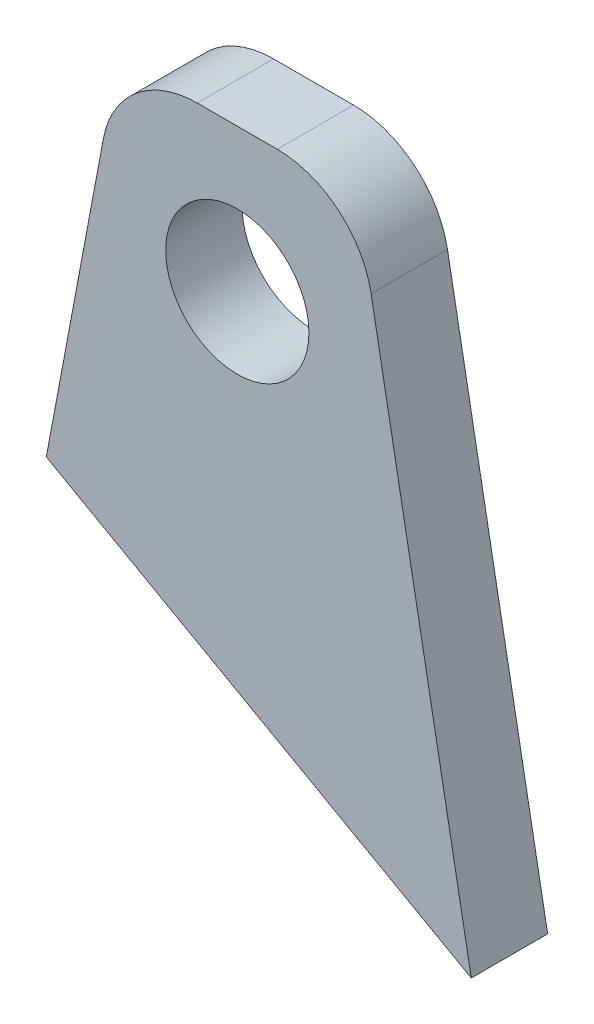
from build123d import *

# Parameters (mm, degrees)
SKETCH_1_R      = 15
EXTRUDE_1_DEPTH = 16


with BuildPart() as part:
    # Sketch 1 → Extrude 1 (new body)
    with BuildSketch(Plane.XY):
        with BuildLine():
            Line((-8.401474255, 30), (8.35433493, 30))
            ThreePointArc((8.35433493, 30), (21.148493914, 25.372361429), (28.021978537, 13.630949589))
            Line((28.021978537, 13.630949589), (49, -100))
            Line((49, -100), (-40, -50))
            Line((-40, -50), (-28.058917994, 13.685770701))
            ThreePointArc((-28.058917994, 13.685770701), (-21.174190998, 25.390182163), (-8.401474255, 30))
        make_face()
        Circle(SKETCH_1_R, mode=Mode.SUBTRACT)
    extrude(amount=EXTRUDE_1_DEPTH)


solid = part.part
